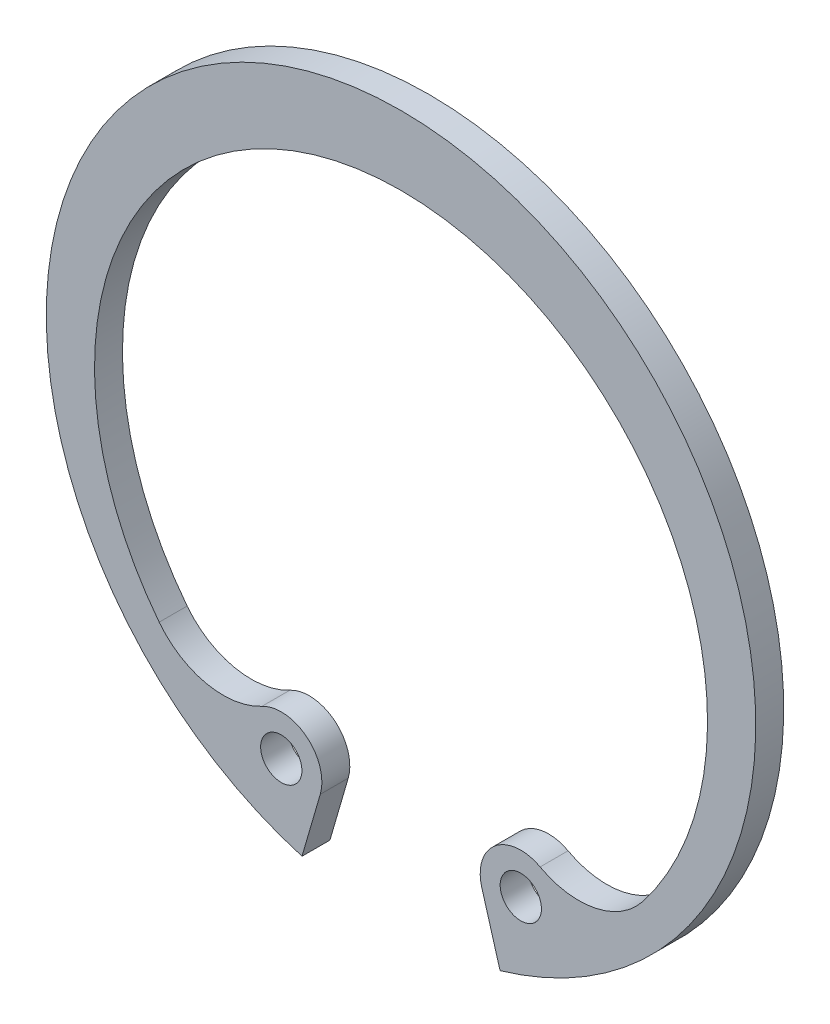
ISO-10303-21;
HEADER;
FILE_DESCRIPTION(('STEP AP214'),'2;1');
FILE_NAME('part.step','',(''),(''),'','','');
FILE_SCHEMA(('AUTOMOTIVE_DESIGN { 1 0 10303 214 1 1 1 1 }'));
ENDSEC;
DATA;
#1=APPLICATION_CONTEXT('core data for automotive mechanical design processes');
#2=APPLICATION_PROTOCOL_DEFINITION('international standard','automotive_design',2000,#1);
#3=PRODUCT_CONTEXT('',#1,'mechanical');
#4=PRODUCT('Part','Part','',(#3));
#5=PRODUCT_RELATED_PRODUCT_CATEGORY('part','',(#4));
#6=PRODUCT_DEFINITION_FORMATION('','',#4);
#7=PRODUCT_DEFINITION_CONTEXT('part definition',#1,'design');
#8=PRODUCT_DEFINITION('design','',#6,#7);
#9=PRODUCT_DEFINITION_SHAPE('','',#8);
#10=(LENGTH_UNIT() NAMED_UNIT(*) SI_UNIT(.MILLI.,.METRE.));
#11=(NAMED_UNIT(*) PLANE_ANGLE_UNIT() SI_UNIT($,.RADIAN.));
#12=(NAMED_UNIT(*) SI_UNIT($,.STERADIAN.) SOLID_ANGLE_UNIT());
#13=UNCERTAINTY_MEASURE_WITH_UNIT(LENGTH_MEASURE(1.E-05),#10,'distance_accuracy_value','');
#14=(GEOMETRIC_REPRESENTATION_CONTEXT(3) GLOBAL_UNCERTAINTY_ASSIGNED_CONTEXT((#13)) GLOBAL_UNIT_ASSIGNED_CONTEXT((#10,
#11,#12)) REPRESENTATION_CONTEXT('',''));
#15=CARTESIAN_POINT('',(0.,0.,0.));
#16=DIRECTION('',(0.,0.,1.));
#17=DIRECTION('',(1.,0.,0.));
#18=AXIS2_PLACEMENT_3D('',#15,#16,#17);
#19=CARTESIAN_POINT('',(0.,0.,-1.0668));
#20=DIRECTION('',(0.,0.,1.));
#21=DIRECTION('',(1.,0.,0.));
#22=AXIS2_PLACEMENT_3D('',#19,#20,#21);
#23=CYLINDRICAL_SURFACE('',#22,13.5382);
#24=CARTESIAN_POINT('',(0.,0.,0.));
#25=DIRECTION('',(0.,0.,1.));
#26=DIRECTION('',(1.,0.,0.));
#27=AXIS2_PLACEMENT_3D('',#24,#25,#26);
#28=CIRCLE('',#27,13.5382);
#29=CARTESIAN_POINT('',(3.77933617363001,-12.9999798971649,0.));
#30=VERTEX_POINT('',#29);
#31=CARTESIAN_POINT('',(-3.77933617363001,-12.9999798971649,0.));
#32=VERTEX_POINT('',#31);
#33=EDGE_CURVE('E130',#30,#32,#28,.T.);
#34=ORIENTED_EDGE('',*,*,#33,.F.);
#35=DIRECTION('',(0.,0.,1.));
#36=VECTOR('',#35,1.);
#37=CARTESIAN_POINT('',(3.77933617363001,-12.9999798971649,-1.0668));
#38=LINE('',#37,#36);
#39=CARTESIAN_POINT('',(3.77933617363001,-12.9999798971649,-1.0668));
#40=VERTEX_POINT('',#39);
#41=EDGE_CURVE('E11',#40,#30,#38,.T.);
#42=ORIENTED_EDGE('',*,*,#41,.F.);
#43=CARTESIAN_POINT('',(0.,0.,-1.0668));
#44=DIRECTION('',(0.,0.,1.));
#45=DIRECTION('',(1.,0.,0.));
#46=AXIS2_PLACEMENT_3D('',#43,#44,#45);
#47=CIRCLE('',#46,13.5382);
#48=CARTESIAN_POINT('',(-3.77933617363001,-12.9999798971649,-1.0668));
#49=VERTEX_POINT('',#48);
#50=EDGE_CURVE('E151',#40,#49,#47,.T.);
#51=ORIENTED_EDGE('',*,*,#50,.T.);
#52=DIRECTION('',(0.,0.,1.));
#53=VECTOR('',#52,1.);
#54=CARTESIAN_POINT('',(-3.77933617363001,-12.9999798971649,-1.0668));
#55=LINE('',#54,#53);
#56=EDGE_CURVE('E36',#49,#32,#55,.T.);
#57=ORIENTED_EDGE('',*,*,#56,.T.);
#58=EDGE_LOOP('',(#34,#42,#51,#57));
#59=FACE_BOUND('',#58,.T.);
#60=ADVANCED_FACE('F33',(#59),#23,.T.);
#61=CARTESIAN_POINT('',(3.77933617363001,-12.9999798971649,-1.0668));
#62=DIRECTION('',(-0.960244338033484,-0.279160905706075,0.));
#63=DIRECTION('',(0.279160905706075,-0.960244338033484,0.));
#64=AXIS2_PLACEMENT_3D('',#61,#62,#63);
#65=PLANE('',#64);
#66=DIRECTION('',(0.279160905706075,-0.960244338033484,0.));
#67=VECTOR('',#66,1.);
#68=CARTESIAN_POINT('',(3.77933617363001,-12.9999798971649,0.));
#69=LINE('',#68,#67);
#70=CARTESIAN_POINT('',(3.0826145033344,-10.6034300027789,0.));
#71=VERTEX_POINT('',#70);
#72=EDGE_CURVE('E149',#71,#30,#69,.T.);
#73=ORIENTED_EDGE('',*,*,#72,.F.);
#74=DIRECTION('',(0.,0.,1.));
#75=VECTOR('',#74,1.);
#76=CARTESIAN_POINT('',(3.0826145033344,-10.6034300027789,-1.0668));
#77=LINE('',#76,#75);
#78=CARTESIAN_POINT('',(3.0826145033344,-10.6034300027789,-1.0668));
#79=VERTEX_POINT('',#78);
#80=EDGE_CURVE('E42',#79,#71,#77,.T.);
#81=ORIENTED_EDGE('',*,*,#80,.F.);
#82=DIRECTION('',(0.279160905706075,-0.960244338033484,0.));
#83=VECTOR('',#82,1.);
#84=CARTESIAN_POINT('',(3.77933617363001,-12.9999798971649,-1.0668));
#85=LINE('',#84,#83);
#86=EDGE_CURVE('E120',#79,#40,#85,.T.);
#87=ORIENTED_EDGE('',*,*,#86,.T.);
#88=ORIENTED_EDGE('',*,*,#41,.T.);
#89=EDGE_LOOP('',(#73,#81,#87,#88));
#90=FACE_BOUND('',#89,.T.);
#91=ADVANCED_FACE('F163',(#90),#65,.T.);
#92=CARTESIAN_POINT('',(4.57041708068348,-10.1708980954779,-1.0668));
#93=DIRECTION('',(0.,0.,1.));
#94=DIRECTION('',(1.,0.,0.));
#95=AXIS2_PLACEMENT_3D('',#92,#93,#94);
#96=CYLINDRICAL_SURFACE('',#95,1.5494);
#97=CARTESIAN_POINT('',(4.57041708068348,-10.1708980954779,0.));
#98=DIRECTION('',(0.,0.,1.));
#99=DIRECTION('',(1.,0.,0.));
#100=AXIS2_PLACEMENT_3D('',#97,#98,#99);
#101=CIRCLE('',#100,1.5494);
#102=CARTESIAN_POINT('',(5.30853516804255,-8.80861249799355,0.));
#103=VERTEX_POINT('',#102);
#104=EDGE_CURVE('E107',#103,#71,#101,.T.);
#105=ORIENTED_EDGE('',*,*,#104,.F.);
#106=DIRECTION('',(0.,0.,1.));
#107=VECTOR('',#106,1.);
#108=CARTESIAN_POINT('',(5.30853516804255,-8.80861249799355,-1.0668));
#109=LINE('',#108,#107);
#110=CARTESIAN_POINT('',(5.30853516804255,-8.80861249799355,-1.0668));
#111=VERTEX_POINT('',#110);
#112=EDGE_CURVE('E102',#111,#103,#109,.T.);
#113=ORIENTED_EDGE('',*,*,#112,.F.);
#114=CARTESIAN_POINT('',(4.57041708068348,-10.1708980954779,-1.0668));
#115=DIRECTION('',(0.,0.,1.));
#116=DIRECTION('',(1.,0.,0.));
#117=AXIS2_PLACEMENT_3D('',#114,#115,#116);
#118=CIRCLE('',#117,1.5494);
#119=EDGE_CURVE('E105',#111,#79,#118,.T.);
#120=ORIENTED_EDGE('',*,*,#119,.T.);
#121=ORIENTED_EDGE('',*,*,#80,.T.);
#122=EDGE_LOOP('',(#105,#113,#120,#121));
#123=FACE_BOUND('',#122,.T.);
#124=ADVANCED_FACE('F104',(#123),#96,.T.);
#125=CARTESIAN_POINT('',(6.78477134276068,-6.08404130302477,-1.0668));
#126=DIRECTION('',(0.,0.,1.));
#127=DIRECTION('',(1.,0.,0.));
#128=AXIS2_PLACEMENT_3D('',#125,#126,#127);
#129=CYLINDRICAL_SURFACE('',#128,3.0988);
#130=CARTESIAN_POINT('',(6.78477134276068,-6.08404130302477,0.));
#131=DIRECTION('',(0.,0.,-1.));
#132=DIRECTION('',(1.,0.,0.));
#133=AXIS2_PLACEMENT_3D('',#130,#131,#132);
#134=CIRCLE('',#133,3.0988);
#135=CARTESIAN_POINT('',(9.22979529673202,-7.98783207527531,0.));
#136=VERTEX_POINT('',#135);
#137=EDGE_CURVE('E146',#136,#103,#134,.T.);
#138=ORIENTED_EDGE('',*,*,#137,.F.);
#139=DIRECTION('',(0.,0.,1.));
#140=VECTOR('',#139,1.);
#141=CARTESIAN_POINT('',(9.22979529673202,-7.98783207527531,-1.0668));
#142=LINE('',#141,#140);
#143=CARTESIAN_POINT('',(9.22979529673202,-7.98783207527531,-1.0668));
#144=VERTEX_POINT('',#143);
#145=EDGE_CURVE('E112',#144,#136,#142,.T.);
#146=ORIENTED_EDGE('',*,*,#145,.F.);
#147=CARTESIAN_POINT('',(6.78477134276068,-6.08404130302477,-1.0668));
#148=DIRECTION('',(0.,0.,-1.));
#149=DIRECTION('',(1.,0.,0.));
#150=AXIS2_PLACEMENT_3D('',#147,#148,#149);
#151=CIRCLE('',#150,3.0988);
#152=EDGE_CURVE('E118',#144,#111,#151,.T.);
#153=ORIENTED_EDGE('',*,*,#152,.T.);
#154=ORIENTED_EDGE('',*,*,#112,.T.);
#155=EDGE_LOOP('',(#138,#146,#153,#154));
#156=FACE_BOUND('',#155,.T.);
#157=ADVANCED_FACE('F122',(#156),#129,.F.);
#158=CARTESIAN_POINT('',(0.,-0.801154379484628,-1.0668));
#159=DIRECTION('',(0.,0.,1.));
#160=DIRECTION('',(1.,0.,0.));
#161=AXIS2_PLACEMENT_3D('',#158,#159,#160);
#162=CYLINDRICAL_SURFACE('',#161,11.6977543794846);
#163=CARTESIAN_POINT('',(0.,-0.801154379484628,0.));
#164=DIRECTION('',(0.,0.,-1.));
#165=DIRECTION('',(1.,0.,0.));
#166=AXIS2_PLACEMENT_3D('',#163,#164,#165);
#167=CIRCLE('',#166,11.6977543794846);
#168=CARTESIAN_POINT('',(-9.22979529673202,-7.98783207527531,0.));
#169=VERTEX_POINT('',#168);
#170=EDGE_CURVE('E143',#169,#136,#167,.T.);
#171=ORIENTED_EDGE('',*,*,#170,.F.);
#172=DIRECTION('',(0.,0.,1.));
#173=VECTOR('',#172,1.);
#174=CARTESIAN_POINT('',(-9.22979529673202,-7.98783207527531,-1.0668));
#175=LINE('',#174,#173);
#176=CARTESIAN_POINT('',(-9.22979529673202,-7.98783207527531,-1.0668));
#177=VERTEX_POINT('',#176);
#178=EDGE_CURVE('E155',#177,#169,#175,.T.);
#179=ORIENTED_EDGE('',*,*,#178,.F.);
#180=CARTESIAN_POINT('',(0.,-0.801154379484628,-1.0668));
#181=DIRECTION('',(0.,0.,-1.));
#182=DIRECTION('',(1.,0.,0.));
#183=AXIS2_PLACEMENT_3D('',#180,#181,#182);
#184=CIRCLE('',#183,11.6977543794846);
#185=EDGE_CURVE('E123',#177,#144,#184,.T.);
#186=ORIENTED_EDGE('',*,*,#185,.T.);
#187=ORIENTED_EDGE('',*,*,#145,.T.);
#188=EDGE_LOOP('',(#171,#179,#186,#187));
#189=FACE_BOUND('',#188,.T.);
#190=ADVANCED_FACE('F176',(#189),#162,.F.);
#191=CARTESIAN_POINT('',(-6.78477134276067,-6.08404130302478,-1.0668));
#192=DIRECTION('',(0.,0.,1.));
#193=DIRECTION('',(1.,0.,0.));
#194=AXIS2_PLACEMENT_3D('',#191,#192,#193);
#195=CYLINDRICAL_SURFACE('',#194,3.0988);
#196=CARTESIAN_POINT('',(-6.78477134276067,-6.08404130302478,0.));
#197=DIRECTION('',(0.,0.,-1.));
#198=DIRECTION('',(1.,0.,0.));
#199=AXIS2_PLACEMENT_3D('',#196,#197,#198);
#200=CIRCLE('',#199,3.0988);
#201=CARTESIAN_POINT('',(-5.30853516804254,-8.80861249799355,0.));
#202=VERTEX_POINT('',#201);
#203=EDGE_CURVE('E140',#202,#169,#200,.T.);
#204=ORIENTED_EDGE('',*,*,#203,.F.);
#205=DIRECTION('',(0.,0.,1.));
#206=VECTOR('',#205,1.);
#207=CARTESIAN_POINT('',(-5.30853516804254,-8.80861249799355,-1.0668));
#208=LINE('',#207,#206);
#209=CARTESIAN_POINT('',(-5.30853516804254,-8.80861249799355,-1.0668));
#210=VERTEX_POINT('',#209);
#211=EDGE_CURVE('E157',#210,#202,#208,.T.);
#212=ORIENTED_EDGE('',*,*,#211,.F.);
#213=CARTESIAN_POINT('',(-6.78477134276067,-6.08404130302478,-1.0668));
#214=DIRECTION('',(0.,0.,-1.));
#215=DIRECTION('',(1.,0.,0.));
#216=AXIS2_PLACEMENT_3D('',#213,#214,#215);
#217=CIRCLE('',#216,3.0988);
#218=EDGE_CURVE('E125',#210,#177,#217,.T.);
#219=ORIENTED_EDGE('',*,*,#218,.T.);
#220=ORIENTED_EDGE('',*,*,#178,.T.);
#221=EDGE_LOOP('',(#204,#212,#219,#220));
#222=FACE_BOUND('',#221,.T.);
#223=ADVANCED_FACE('F179',(#222),#195,.F.);
#224=CARTESIAN_POINT('',(-4.57041708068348,-10.1708980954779,-1.0668));
#225=DIRECTION('',(0.,0.,1.));
#226=DIRECTION('',(1.,0.,0.));
#227=AXIS2_PLACEMENT_3D('',#224,#225,#226);
#228=CYLINDRICAL_SURFACE('',#227,1.5494);
#229=CARTESIAN_POINT('',(-4.57041708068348,-10.1708980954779,0.));
#230=DIRECTION('',(0.,0.,1.));
#231=DIRECTION('',(1.,0.,0.));
#232=AXIS2_PLACEMENT_3D('',#229,#230,#231);
#233=CIRCLE('',#232,1.5494);
#234=CARTESIAN_POINT('',(-3.0826145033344,-10.6034300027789,0.));
#235=VERTEX_POINT('',#234);
#236=EDGE_CURVE('E137',#235,#202,#233,.T.);
#237=ORIENTED_EDGE('',*,*,#236,.F.);
#238=DIRECTION('',(0.,0.,1.));
#239=VECTOR('',#238,1.);
#240=CARTESIAN_POINT('',(-3.0826145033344,-10.6034300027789,-1.0668));
#241=LINE('',#240,#239);
#242=CARTESIAN_POINT('',(-3.0826145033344,-10.6034300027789,-1.0668));
#243=VERTEX_POINT('',#242);
#244=EDGE_CURVE('E158',#243,#235,#241,.T.);
#245=ORIENTED_EDGE('',*,*,#244,.F.);
#246=CARTESIAN_POINT('',(-4.57041708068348,-10.1708980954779,-1.0668));
#247=DIRECTION('',(0.,0.,1.));
#248=DIRECTION('',(1.,0.,0.));
#249=AXIS2_PLACEMENT_3D('',#246,#247,#248);
#250=CIRCLE('',#249,1.5494);
#251=EDGE_CURVE('E225',#243,#210,#250,.T.);
#252=ORIENTED_EDGE('',*,*,#251,.T.);
#253=ORIENTED_EDGE('',*,*,#211,.T.);
#254=EDGE_LOOP('',(#237,#245,#252,#253));
#255=FACE_BOUND('',#254,.T.);
#256=ADVANCED_FACE('F183',(#255),#228,.T.);
#257=CARTESIAN_POINT('',(-3.77933617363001,-12.9999798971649,-1.0668));
#258=DIRECTION('',(0.960244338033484,-0.279160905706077,0.));
#259=DIRECTION('',(0.279160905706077,0.960244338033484,0.));
#260=AXIS2_PLACEMENT_3D('',#257,#258,#259);
#261=PLANE('',#260);
#262=DIRECTION('',(0.279160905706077,0.960244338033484,0.));
#263=VECTOR('',#262,1.);
#264=CARTESIAN_POINT('',(-3.77933617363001,-12.9999798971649,0.));
#265=LINE('',#264,#263);
#266=EDGE_CURVE('E133',#32,#235,#265,.T.);
#267=ORIENTED_EDGE('',*,*,#266,.F.);
#268=ORIENTED_EDGE('',*,*,#56,.F.);
#269=DIRECTION('',(0.279160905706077,0.960244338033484,0.));
#270=VECTOR('',#269,1.);
#271=CARTESIAN_POINT('',(-3.77933617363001,-12.9999798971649,-1.0668));
#272=LINE('',#271,#270);
#273=EDGE_CURVE('E223',#49,#243,#272,.T.);
#274=ORIENTED_EDGE('',*,*,#273,.T.);
#275=ORIENTED_EDGE('',*,*,#244,.T.);
#276=EDGE_LOOP('',(#267,#268,#274,#275));
#277=FACE_BOUND('',#276,.T.);
#278=ADVANCED_FACE('F160',(#277),#261,.T.);
#279=CARTESIAN_POINT('',(0.,0.,-1.0668));
#280=DIRECTION('',(0.,0.,1.));
#281=DIRECTION('',(1.,0.,0.));
#282=AXIS2_PLACEMENT_3D('',#279,#280,#281);
#283=PLANE('',#282);
#284=CARTESIAN_POINT('',(-4.57041708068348,-10.1708980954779,-1.0668));
#285=DIRECTION('',(0.,0.,1.));
#286=DIRECTION('',(1.,0.,0.));
#287=AXIS2_PLACEMENT_3D('',#284,#285,#286);
#288=CIRCLE('',#287,0.787399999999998);
#289=CARTESIAN_POINT('',(-3.78301708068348,-10.1708980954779,-1.0668));
#290=VERTEX_POINT('',#289);
#291=EDGE_CURVE('E210',#290,#290,#288,.T.);
#292=ORIENTED_EDGE('',*,*,#291,.T.);
#293=EDGE_LOOP('',(#292));
#294=FACE_BOUND('',#293,.T.);
#295=CARTESIAN_POINT('',(4.57041708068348,-10.1708980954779,-1.0668));
#296=DIRECTION('',(0.,0.,1.));
#297=DIRECTION('',(1.,0.,0.));
#298=AXIS2_PLACEMENT_3D('',#295,#296,#297);
#299=CIRCLE('',#298,0.787399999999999);
#300=CARTESIAN_POINT('',(5.35781708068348,-10.1708980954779,-1.0668));
#301=VERTEX_POINT('',#300);
#302=EDGE_CURVE('E134',#301,#301,#299,.T.);
#303=ORIENTED_EDGE('',*,*,#302,.T.);
#304=EDGE_LOOP('',(#303));
#305=FACE_BOUND('',#304,.T.);
#306=ORIENTED_EDGE('',*,*,#50,.F.);
#307=ORIENTED_EDGE('',*,*,#86,.F.);
#308=ORIENTED_EDGE('',*,*,#119,.F.);
#309=ORIENTED_EDGE('',*,*,#152,.F.);
#310=ORIENTED_EDGE('',*,*,#185,.F.);
#311=ORIENTED_EDGE('',*,*,#218,.F.);
#312=ORIENTED_EDGE('',*,*,#251,.F.);
#313=ORIENTED_EDGE('',*,*,#273,.F.);
#314=EDGE_LOOP('',(#306,#307,#308,#309,#310,#311,#312,#313));
#315=FACE_BOUND('',#314,.T.);
#316=ADVANCED_FACE('F116',(#294,#305,#315),#283,.F.);
#317=CARTESIAN_POINT('',(0.,0.,0.));
#318=DIRECTION('',(0.,0.,1.));
#319=DIRECTION('',(1.,0.,0.));
#320=AXIS2_PLACEMENT_3D('',#317,#318,#319);
#321=PLANE('',#320);
#322=CARTESIAN_POINT('',(-4.57041708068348,-10.1708980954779,0.));
#323=DIRECTION('',(0.,0.,1.));
#324=DIRECTION('',(1.,0.,0.));
#325=AXIS2_PLACEMENT_3D('',#322,#323,#324);
#326=CIRCLE('',#325,0.787399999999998);
#327=CARTESIAN_POINT('',(-3.78301708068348,-10.1708980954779,0.));
#328=VERTEX_POINT('',#327);
#329=EDGE_CURVE('E213',#328,#328,#326,.T.);
#330=ORIENTED_EDGE('',*,*,#329,.F.);
#331=EDGE_LOOP('',(#330));
#332=FACE_BOUND('',#331,.T.);
#333=CARTESIAN_POINT('',(4.57041708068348,-10.1708980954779,0.));
#334=DIRECTION('',(0.,0.,1.));
#335=DIRECTION('',(1.,0.,0.));
#336=AXIS2_PLACEMENT_3D('',#333,#334,#335);
#337=CIRCLE('',#336,0.787399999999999);
#338=CARTESIAN_POINT('',(5.35781708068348,-10.1708980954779,0.));
#339=VERTEX_POINT('',#338);
#340=EDGE_CURVE('E215',#339,#339,#337,.T.);
#341=ORIENTED_EDGE('',*,*,#340,.F.);
#342=EDGE_LOOP('',(#341));
#343=FACE_BOUND('',#342,.T.);
#344=ORIENTED_EDGE('',*,*,#33,.T.);
#345=ORIENTED_EDGE('',*,*,#266,.T.);
#346=ORIENTED_EDGE('',*,*,#236,.T.);
#347=ORIENTED_EDGE('',*,*,#203,.T.);
#348=ORIENTED_EDGE('',*,*,#170,.T.);
#349=ORIENTED_EDGE('',*,*,#137,.T.);
#350=ORIENTED_EDGE('',*,*,#104,.T.);
#351=ORIENTED_EDGE('',*,*,#72,.T.);
#352=EDGE_LOOP('',(#344,#345,#346,#347,#348,#349,#350,#351));
#353=FACE_BOUND('',#352,.T.);
#354=ADVANCED_FACE('F162',(#332,#343,#353),#321,.T.);
#355=CARTESIAN_POINT('',(4.57041708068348,-10.1708980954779,-1.0668));
#356=DIRECTION('',(0.,0.,1.));
#357=DIRECTION('',(1.,0.,0.));
#358=AXIS2_PLACEMENT_3D('',#355,#356,#357);
#359=CYLINDRICAL_SURFACE('',#358,0.787399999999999);
#360=ORIENTED_EDGE('',*,*,#302,.F.);
#361=EDGE_LOOP('',(#360));
#362=FACE_BOUND('',#361,.T.);
#363=ORIENTED_EDGE('',*,*,#340,.T.);
#364=EDGE_LOOP('',(#363));
#365=FACE_BOUND('',#364,.T.);
#366=ADVANCED_FACE('F195',(#362,#365),#359,.F.);
#367=CARTESIAN_POINT('',(-4.57041708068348,-10.1708980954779,-1.0668));
#368=DIRECTION('',(0.,0.,1.));
#369=DIRECTION('',(1.,0.,0.));
#370=AXIS2_PLACEMENT_3D('',#367,#368,#369);
#371=CYLINDRICAL_SURFACE('',#370,0.787399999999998);
#372=ORIENTED_EDGE('',*,*,#291,.F.);
#373=EDGE_LOOP('',(#372));
#374=FACE_BOUND('',#373,.T.);
#375=ORIENTED_EDGE('',*,*,#329,.T.);
#376=EDGE_LOOP('',(#375));
#377=FACE_BOUND('',#376,.T.);
#378=ADVANCED_FACE('F202',(#374,#377),#371,.F.);
#379=CLOSED_SHELL('',(#60,#91,#124,#157,#190,#223,#256,#278,#316,#354,#366,#378));
#380=MANIFOLD_SOLID_BREP('B2',#379);
#381=ADVANCED_BREP_SHAPE_REPRESENTATION('',(#18,#380),#14);
#382=SHAPE_DEFINITION_REPRESENTATION(#9,#381);
ENDSEC;
END-ISO-10303-21;
